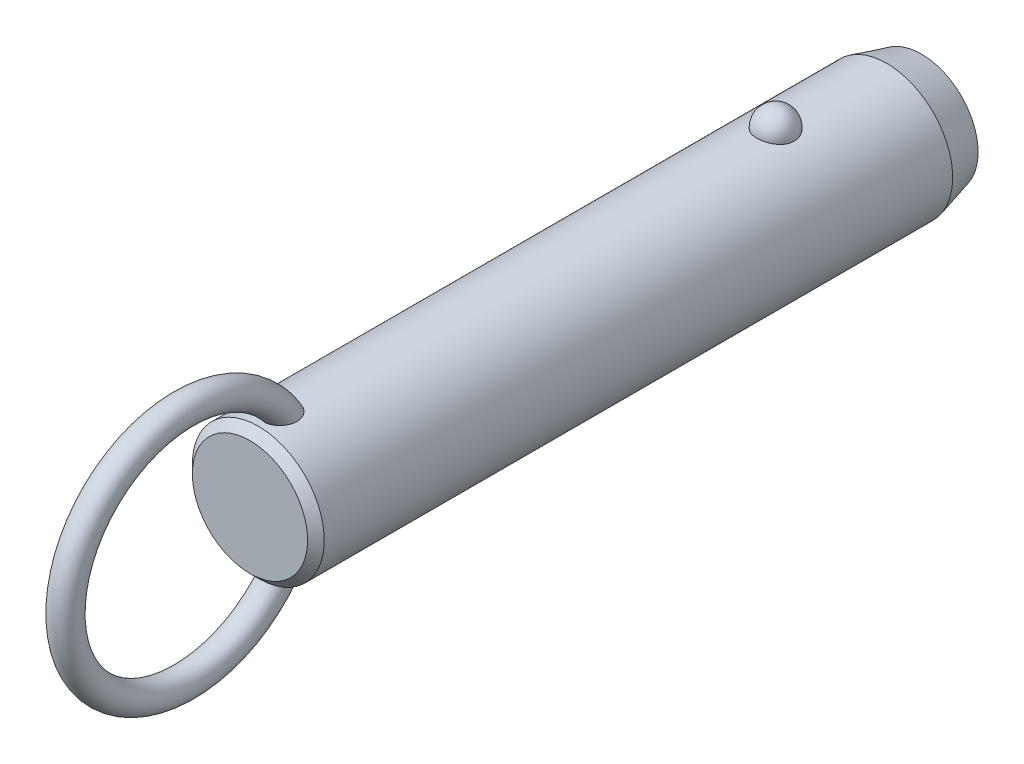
ISO-10303-21;
HEADER;
FILE_DESCRIPTION(('STEP AP214'),'2;1');
FILE_NAME('part.step','',(''),(''),'','','');
FILE_SCHEMA(('AUTOMOTIVE_DESIGN { 1 0 10303 214 1 1 1 1 }'));
ENDSEC;
DATA;
#1=APPLICATION_CONTEXT('core data for automotive mechanical design processes');
#2=APPLICATION_PROTOCOL_DEFINITION('international standard','automotive_design',2000,#1);
#3=PRODUCT_CONTEXT('',#1,'mechanical');
#4=PRODUCT('Part','Part','',(#3));
#5=PRODUCT_RELATED_PRODUCT_CATEGORY('part','',(#4));
#6=PRODUCT_DEFINITION_FORMATION('','',#4);
#7=PRODUCT_DEFINITION_CONTEXT('part definition',#1,'design');
#8=PRODUCT_DEFINITION('design','',#6,#7);
#9=PRODUCT_DEFINITION_SHAPE('','',#8);
#10=(LENGTH_UNIT() NAMED_UNIT(*) SI_UNIT(.MILLI.,.METRE.));
#11=(NAMED_UNIT(*) PLANE_ANGLE_UNIT() SI_UNIT($,.RADIAN.));
#12=(NAMED_UNIT(*) SI_UNIT($,.STERADIAN.) SOLID_ANGLE_UNIT());
#13=UNCERTAINTY_MEASURE_WITH_UNIT(LENGTH_MEASURE(1.E-05),#10,'distance_accuracy_value','');
#14=(GEOMETRIC_REPRESENTATION_CONTEXT(3) GLOBAL_UNCERTAINTY_ASSIGNED_CONTEXT((#13)) GLOBAL_UNIT_ASSIGNED_CONTEXT((#10,
#11,#12)) REPRESENTATION_CONTEXT('',''));
#15=CARTESIAN_POINT('',(0.,0.,0.));
#16=DIRECTION('',(0.,0.,1.));
#17=DIRECTION('',(1.,0.,0.));
#18=AXIS2_PLACEMENT_3D('',#15,#16,#17);
#19=CARTESIAN_POINT('',(0.,0.,63.5));
#20=DIRECTION('',(0.,0.,-1.));
#21=DIRECTION('',(-1.,0.,0.));
#22=AXIS2_PLACEMENT_3D('',#19,#20,#21);
#23=CYLINDRICAL_SURFACE('',#22,9.5);
#24=CARTESIAN_POINT('',(2.67259918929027,9.11631578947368,-2.70000000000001));
#25=CARTESIAN_POINT('',(2.6725968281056,9.11631786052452,-2.54909854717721));
#26=CARTESIAN_POINT('',(2.66030567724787,9.11994722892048,-2.39816735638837));
#27=CARTESIAN_POINT('',(2.6114347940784,9.13405924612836,-2.10058568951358));
#28=CARTESIAN_POINT('',(2.57484658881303,9.14454428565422,-1.95393672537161));
#29=CARTESIAN_POINT('',(2.47830875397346,9.17117631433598,-1.66916069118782));
#30=CARTESIAN_POINT('',(2.41836936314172,9.18732082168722,-1.53102991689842));
#31=CARTESIAN_POINT('',(2.27661331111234,9.22346780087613,-1.26705393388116));
#32=CARTESIAN_POINT('',(2.19479699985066,9.24347021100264,-1.14120852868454));
#33=CARTESIAN_POINT('',(2.01085282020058,9.28522401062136,-0.904632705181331));
#34=CARTESIAN_POINT('',(1.90862396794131,9.30698376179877,-0.793982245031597));
#35=CARTESIAN_POINT('',(1.6867437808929,9.34973971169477,-0.591607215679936));
#36=CARTESIAN_POINT('',(1.56709244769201,9.37073591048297,-0.499882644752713));
#37=CARTESIAN_POINT('',(1.31393976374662,9.40956370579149,-0.338167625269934));
#38=CARTESIAN_POINT('',(1.18048026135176,9.42740444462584,-0.268113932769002));
#39=CARTESIAN_POINT('',(0.903154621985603,9.45799906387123,-0.151390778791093));
#40=CARTESIAN_POINT('',(0.759289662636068,9.47075351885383,-0.104718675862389));
#41=CARTESIAN_POINT('',(0.468074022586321,9.48956256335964,-0.0367633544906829));
#42=CARTESIAN_POINT('',(0.320836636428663,9.49573643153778,-0.0150275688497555));
#43=CARTESIAN_POINT('',(0.0246714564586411,9.50112183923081,0.00396199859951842));
#44=CARTESIAN_POINT('',(-0.124256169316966,9.50033406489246,0.00121819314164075));
#45=CARTESIAN_POINT('',(-0.417264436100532,9.4919475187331,-0.0284441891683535));
#46=CARTESIAN_POINT('',(-0.56138413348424,9.48444885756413,-0.0550074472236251));
#47=CARTESIAN_POINT('',(-0.842986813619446,9.46357853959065,-0.131064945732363));
#48=CARTESIAN_POINT('',(-0.980469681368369,9.450206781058,-0.180559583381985));
#49=CARTESIAN_POINT('',(-1.24585005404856,9.41890822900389,-0.301476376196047));
#50=CARTESIAN_POINT('',(-1.37368611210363,9.40095498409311,-0.373026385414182));
#51=CARTESIAN_POINT('',(-1.61552738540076,9.36242964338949,-0.536025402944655));
#52=CARTESIAN_POINT('',(-1.72953116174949,9.34185727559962,-0.627476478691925));
#53=CARTESIAN_POINT('',(-1.9429225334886,9.29984568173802,-0.829844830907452));
#54=CARTESIAN_POINT('',(-2.04198021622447,9.27839736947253,-0.94110821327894));
#55=CARTESIAN_POINT('',(-2.22026460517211,9.23735994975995,-1.17883414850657));
#56=CARTESIAN_POINT('',(-2.29948985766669,9.21777097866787,-1.30529781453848));
#57=CARTESIAN_POINT('',(-2.43697287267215,9.18238994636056,-1.57158566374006));
#58=CARTESIAN_POINT('',(-2.49497068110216,9.16664569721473,-1.71155057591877));
#59=CARTESIAN_POINT('',(-2.5872073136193,9.14104303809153,-1.99961197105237));
#60=CARTESIAN_POINT('',(-2.62144683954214,9.13118445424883,-2.14770821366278));
#61=CARTESIAN_POINT('',(-2.66521466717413,9.11850622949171,-2.44715424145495));
#62=CARTESIAN_POINT('',(-2.67484831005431,9.11565658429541,-2.59848735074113));
#63=CARTESIAN_POINT('',(-2.66946735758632,9.11723375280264,-2.90067317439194));
#64=CARTESIAN_POINT('',(-2.65445345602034,9.12166036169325,-3.05152590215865));
#65=CARTESIAN_POINT('',(-2.60029711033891,9.13724422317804,-3.34766110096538));
#66=CARTESIAN_POINT('',(-2.56127978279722,9.14836656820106,-3.49296833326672));
#67=CARTESIAN_POINT('',(-2.46018844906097,9.17606676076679,-3.77477535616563));
#68=CARTESIAN_POINT('',(-2.39811349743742,9.1926448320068,-3.9112747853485));
#69=CARTESIAN_POINT('',(-2.25202303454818,9.22952198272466,-4.17244273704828));
#70=CARTESIAN_POINT('',(-2.16788714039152,9.24984129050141,-4.29704106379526));
#71=CARTESIAN_POINT('',(-1.9799408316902,9.29188255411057,-4.53013066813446));
#72=CARTESIAN_POINT('',(-1.87612963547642,9.31360456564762,-4.63862130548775));
#73=CARTESIAN_POINT('',(-1.65105429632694,9.35612959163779,-4.8369029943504));
#74=CARTESIAN_POINT('',(-1.52972405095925,9.37692871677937,-4.92661991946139));
#75=CARTESIAN_POINT('',(-1.27318250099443,9.41518970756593,-5.08429106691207));
#76=CARTESIAN_POINT('',(-1.13797219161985,9.432651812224,-5.15224684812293));
#77=CARTESIAN_POINT('',(-0.859280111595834,9.46208255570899,-5.26371827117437));
#78=CARTESIAN_POINT('',(-0.715925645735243,9.47411833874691,-5.30753421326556));
#79=CARTESIAN_POINT('',(-0.423550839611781,9.4916822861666,-5.37076321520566));
#80=CARTESIAN_POINT('',(-0.2745312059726,9.49721125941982,-5.39017930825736));
#81=CARTESIAN_POINT('',(0.0218446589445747,9.50110860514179,-5.40390587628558));
#82=CARTESIAN_POINT('',(0.16917707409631,9.49961381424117,-5.39869609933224));
#83=CARTESIAN_POINT('',(0.460808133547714,9.48993906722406,-5.36441955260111));
#84=CARTESIAN_POINT('',(0.605106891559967,9.48175936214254,-5.33535367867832));
#85=CARTESIAN_POINT('',(0.886027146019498,9.4596376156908,-5.25435587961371));
#86=CARTESIAN_POINT('',(1.02267710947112,9.44571881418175,-5.20251612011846));
#87=CARTESIAN_POINT('',(1.28523827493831,9.41358993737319,-5.07741549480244));
#88=CARTESIAN_POINT('',(1.41114877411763,9.39537958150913,-5.00415322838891));
#89=CARTESIAN_POINT('',(1.65085227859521,9.3562644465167,-4.83684599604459));
#90=CARTESIAN_POINT('',(1.76442346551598,9.33532178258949,-4.74249218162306));
#91=CARTESIAN_POINT('',(1.97425672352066,9.29321198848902,-4.53620389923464));
#92=CARTESIAN_POINT('',(2.07051582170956,9.27204482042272,-4.42426641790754));
#93=CARTESIAN_POINT('',(2.24490086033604,9.23139221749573,-4.18363183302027));
#94=CARTESIAN_POINT('',(2.32267019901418,9.21194380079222,-4.05466990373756));
#95=CARTESIAN_POINT('',(2.45584092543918,9.1773419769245,-3.78517836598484));
#96=CARTESIAN_POINT('',(2.5112497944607,9.16218713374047,-3.64465264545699));
#97=CARTESIAN_POINT('',(2.59380876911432,9.13913522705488,-3.37104301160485));
#98=CARTESIAN_POINT('',(2.62330266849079,9.13064624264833,-3.23871053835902));
#99=CARTESIAN_POINT('',(2.66269870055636,9.11923566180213,-2.97092664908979));
#100=CARTESIAN_POINT('',(2.67260130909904,9.11631393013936,-2.83547530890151));
#101=CARTESIAN_POINT('',(2.67259918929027,9.11631578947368,-2.70000000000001));
#102=B_SPLINE_CURVE_WITH_KNOTS('',3,(#24,#25,#26,#27,#28,#29,#30,#31,#32,#33,#34,#35,#36,#37,
#38,#39,#40,#41,#42,#43,#44,#45,#46,#47,#48,#49,#50,#51,#52,#53,#54,#55,#56,#57,#58,#59,#60,#61,
#62,#63,#64,#65,#66,#67,#68,#69,#70,#71,#72,#73,#74,#75,#76,#77,#78,#79,#80,#81,#82,#83,#84,#85,
#86,#87,#88,#89,#90,#91,#92,#93,#94,#95,#96,#97,#98,#99,#100,#101),.UNSPECIFIED.,.T.,.F.,(4,2,2,
2,2,2,2,2,2,2,2,2,2,2,2,2,2,2,2,2,2,2,2,2,2,2,2,2,2,2,2,2,2,2,2,2,2,2,4),(0.,0.452217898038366,
0.904593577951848,1.35677112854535,1.80894144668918,2.26340676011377,2.71787203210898,
3.17099820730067,3.62407318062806,4.0687883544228,4.51345969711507,4.95160616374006,
5.38976021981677,5.83050358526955,6.27129275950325,6.72071308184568,7.17016633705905,
7.62495278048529,8.07972578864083,8.53254856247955,8.98535859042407,9.43582813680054,
9.88631615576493,10.3393155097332,10.7923328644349,11.2471065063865,11.7018475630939,
12.150795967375,12.599688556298,13.0398725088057,13.4800399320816,13.9184421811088,
14.3568730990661,14.802202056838,15.2476074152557,15.7010097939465,16.1542603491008,
16.5602594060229,16.966248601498),.UNSPECIFIED.);
#103=CARTESIAN_POINT('',(2.67259918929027,9.11631578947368,-2.70000000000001));
#104=VERTEX_POINT('',#103);
#105=EDGE_CURVE('E41',#104,#104,#102,.T.);
#106=ORIENTED_EDGE('',*,*,#105,.T.);
#107=EDGE_LOOP('',(#106));
#108=FACE_BOUND('',#107,.T.);
#109=CARTESIAN_POINT('',(0.,0.,71.82));
#110=DIRECTION('',(0.,0.,1.));
#111=DIRECTION('',(1.,0.,0.));
#112=AXIS2_PLACEMENT_3D('',#109,#110,#111);
#113=CIRCLE('',#112,9.5);
#114=CARTESIAN_POINT('',(-9.50000000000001,0.,71.82));
#115=VERTEX_POINT('',#114);
#116=EDGE_CURVE('E10',#115,#115,#113,.F.);
#117=ORIENTED_EDGE('',*,*,#116,.T.);
#118=EDGE_LOOP('',(#117));
#119=FACE_BOUND('',#118,.T.);
#120=CARTESIAN_POINT('',(-0.697062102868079,-9.47439269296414,66.1678088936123));
#121=CARTESIAN_POINT('',(-0.799579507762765,-9.46685146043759,66.2074823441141));
#122=CARTESIAN_POINT('',(-0.898575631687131,-9.45788043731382,66.2559309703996));
#123=CARTESIAN_POINT('',(-1.08670047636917,-9.43811593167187,66.3688685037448));
#124=CARTESIAN_POINT('',(-1.17583204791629,-9.42732297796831,66.4333527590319));
#125=CARTESIAN_POINT('',(-1.34179806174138,-9.40513672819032,66.5762099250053));
#126=CARTESIAN_POINT('',(-1.41865133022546,-9.39374438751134,66.654561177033));
#127=CARTESIAN_POINT('',(-1.5586004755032,-9.37154196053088,66.8227524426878));
#128=CARTESIAN_POINT('',(-1.62169476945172,-9.3607319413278,66.9125937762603));
#129=CARTESIAN_POINT('',(-1.73527695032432,-9.34035749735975,67.1045001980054));
#130=CARTESIAN_POINT('',(-1.7852226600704,-9.33085270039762,67.2068910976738));
#131=CARTESIAN_POINT('',(-1.86924997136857,-9.3143834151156,67.418148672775));
#132=CARTESIAN_POINT('',(-1.90332570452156,-9.30741986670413,67.5270177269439));
#133=CARTESIAN_POINT('',(-1.95893603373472,-9.29588482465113,67.7604730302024));
#134=CARTESIAN_POINT('',(-1.97872420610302,-9.29165182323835,67.8854890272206));
#135=CARTESIAN_POINT('',(-2.00062129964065,-9.28695978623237,68.1370805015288));
#136=CARTESIAN_POINT('',(-2.00272284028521,-9.28650232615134,68.263656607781));
#137=CARTESIAN_POINT('',(-1.98958876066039,-9.28932750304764,68.5368157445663));
#138=CARTESIAN_POINT('',(-1.97143366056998,-9.2932400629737,68.6832519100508));
#139=CARTESIAN_POINT('',(-1.91479925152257,-9.30507151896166,68.9720629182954));
#140=CARTESIAN_POINT('',(-1.87629122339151,-9.31299607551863,69.114431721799));
#141=CARTESIAN_POINT('',(-1.77225683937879,-9.33340232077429,69.4151725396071));
#142=CARTESIAN_POINT('',(-1.70334898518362,-9.34641636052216,69.5723691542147));
#143=CARTESIAN_POINT('',(-1.58111062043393,-9.36759153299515,69.7975171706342));
#144=CARTESIAN_POINT('',(-1.53721459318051,-9.37492619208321,69.8707968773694));
#145=CARTESIAN_POINT('',(-1.44302631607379,-9.38988566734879,70.0130740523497));
#146=CARTESIAN_POINT('',(-1.39273721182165,-9.39751033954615,70.0820736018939));
#147=CARTESIAN_POINT('',(-1.26775962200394,-9.41530678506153,70.2369832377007));
#148=CARTESIAN_POINT('',(-1.19052326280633,-9.42548108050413,70.3208712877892));
#149=CARTESIAN_POINT('',(-1.02420241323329,-9.44499825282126,70.4760086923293));
#150=CARTESIAN_POINT('',(-0.935139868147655,-9.45434261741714,70.5472808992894));
#151=CARTESIAN_POINT('',(-0.766610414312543,-9.46930670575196,70.6586955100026));
#152=CARTESIAN_POINT('',(-0.689439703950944,-9.47529223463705,70.7022354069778));
#153=CARTESIAN_POINT('',(-0.528942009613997,-9.48560294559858,70.7763133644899));
#154=CARTESIAN_POINT('',(-0.445620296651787,-9.48992953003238,70.8068624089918));
#155=CARTESIAN_POINT('',(-0.273901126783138,-9.49644161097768,70.8525792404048));
#156=CARTESIAN_POINT('',(-0.185465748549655,-9.49860811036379,70.86761059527));
#157=CARTESIAN_POINT('',(-0.00734541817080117,-9.5004135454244,70.8801494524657));
#158=CARTESIAN_POINT('',(0.0823387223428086,-9.50005405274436,70.8776678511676));
#159=CARTESIAN_POINT('',(0.247679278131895,-9.49708301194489,70.8569959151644));
#160=CARTESIAN_POINT('',(0.323620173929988,-9.49477609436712,70.8409300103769));
#161=CARTESIAN_POINT('',(0.471981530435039,-9.48855917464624,70.7971726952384));
#162=CARTESIAN_POINT('',(0.544400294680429,-9.48464840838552,70.769475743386));
#163=CARTESIAN_POINT('',(0.70894789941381,-9.47398336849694,70.6928026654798));
#164=CARTESIAN_POINT('',(0.799149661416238,-9.46671310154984,70.6397745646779));
#165=CARTESIAN_POINT('',(0.969783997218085,-9.45076225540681,70.5199731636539));
#166=CARTESIAN_POINT('',(1.05019415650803,-9.44207854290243,70.4531692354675));
#167=CARTESIAN_POINT('',(1.23092343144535,-9.42051459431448,70.2807596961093));
#168=CARTESIAN_POINT('',(1.3265249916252,-9.40733378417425,70.1702619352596));
#169=CARTESIAN_POINT('',(1.49893121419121,-9.38140745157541,69.9355614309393));
#170=CARTESIAN_POINT('',(1.57571616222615,-9.36866239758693,69.8113445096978));
#171=CARTESIAN_POINT('',(1.71285426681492,-9.34457644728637,69.5493891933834));
#172=CARTESIAN_POINT('',(1.77266365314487,-9.33328726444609,69.4113623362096));
#173=CARTESIAN_POINT('',(1.87239208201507,-9.31379209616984,69.1280515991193));
#174=CARTESIAN_POINT('',(1.9123015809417,-9.3055875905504,68.982764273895));
#175=CARTESIAN_POINT('',(1.97604189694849,-9.29228394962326,68.6620281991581));
#176=CARTESIAN_POINT('',(1.99587438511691,-9.28797202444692,68.4857248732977));
#177=CARTESIAN_POINT('',(2.0029570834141,-9.28645519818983,68.1324146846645));
#178=CARTESIAN_POINT('',(1.99025930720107,-9.28923895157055,67.9554093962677));
#179=CARTESIAN_POINT('',(1.93735479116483,-9.30038134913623,67.6563381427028));
#180=CARTESIAN_POINT('',(1.90576827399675,-9.30697680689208,67.5326679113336));
#181=CARTESIAN_POINT('',(1.82287484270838,-9.32356855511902,67.292329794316));
#182=CARTESIAN_POINT('',(1.77158213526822,-9.33356239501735,67.1756569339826));
#183=CARTESIAN_POINT('',(1.64885744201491,-9.35602275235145,66.9527061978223));
#184=CARTESIAN_POINT('',(1.57730995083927,-9.36850332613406,66.8464927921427));
#185=CARTESIAN_POINT('',(1.4154326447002,-9.39431873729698,66.6495530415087));
#186=CARTESIAN_POINT('',(1.32510883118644,-9.40765330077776,66.5588217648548));
#187=CARTESIAN_POINT('',(1.13846223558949,-9.43195720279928,66.4050334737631));
#188=CARTESIAN_POINT('',(1.04369890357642,-9.44302894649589,66.3400947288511));
#189=CARTESIAN_POINT('',(0.843965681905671,-9.46296805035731,66.2280388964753));
#190=CARTESIAN_POINT('',(0.739000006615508,-9.47183631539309,66.1809144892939));
#191=CARTESIAN_POINT('',(0.528175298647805,-9.48586140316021,66.1081173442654));
#192=CARTESIAN_POINT('',(0.422686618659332,-9.49119633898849,66.0814024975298));
#193=CARTESIAN_POINT('',(0.208590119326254,-9.49831365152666,66.0460137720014));
#194=CARTESIAN_POINT('',(0.0999817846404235,-9.500095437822,66.0373428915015));
#195=CARTESIAN_POINT('',(-0.126104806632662,-9.49988861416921,66.0383501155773));
#196=CARTESIAN_POINT('',(-0.24357872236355,-9.49757821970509,66.0495942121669));
#197=CARTESIAN_POINT('',(-0.474390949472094,-9.48885165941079,66.093167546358));
#198=CARTESIAN_POINT('',(-0.587729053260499,-9.48243528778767,66.1254978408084));
#199=CARTESIAN_POINT('',(-0.697062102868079,-9.47439269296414,66.1678088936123));
#200=B_SPLINE_CURVE_WITH_KNOTS('',3,(#120,#121,#122,#123,#124,#125,#126,#127,#128,#129,#130,
#131,#132,#133,#134,#135,#136,#137,#138,#139,#140,#141,#142,#143,#144,#145,#146,#147,#148,#149,
#150,#151,#152,#153,#154,#155,#156,#157,#158,#159,#160,#161,#162,#163,#164,#165,#166,#167,#168,
#169,#170,#171,#172,#173,#174,#175,#176,#177,#178,#179,#180,#181,#182,#183,#184,#185,#186,#187,
#188,#189,#190,#191,#192,#193,#194,#195,#196,#197,#198,#199),.UNSPECIFIED.,.T.,.F.,(4,2,2,2,2,2,
2,2,2,2,2,2,2,2,2,2,2,2,2,2,2,2,2,2,2,2,2,2,2,2,2,2,2,2,2,2,2,2,2,4),(0.,0.330119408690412,
0.660143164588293,0.989655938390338,1.31920659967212,1.66074728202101,2.00241415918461,
2.38088696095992,2.7595176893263,3.20065679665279,3.6424200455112,4.15620996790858,
4.4131416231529,4.66994734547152,5.01228664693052,5.35399933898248,5.61943037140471,
5.88463652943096,6.15215502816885,6.41950709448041,6.65144391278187,6.88349136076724,
7.19641200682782,7.51003602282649,7.94779711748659,8.38601491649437,8.83699707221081,
9.28819530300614,9.81778662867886,10.3465317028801,10.7284172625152,11.110028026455,
11.4938603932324,11.8775702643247,12.2220189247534,12.5663259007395,12.8915939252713,
13.2169159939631,13.5689650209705,13.9210316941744),.UNSPECIFIED.);
#201=CARTESIAN_POINT('',(-0.697062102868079,-9.47439269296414,66.1678088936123));
#202=VERTEX_POINT('',#201);
#203=EDGE_CURVE('E59',#202,#202,#200,.T.);
#204=ORIENTED_EDGE('',*,*,#203,.T.);
#205=EDGE_LOOP('',(#204));
#206=FACE_BOUND('',#205,.T.);
#207=CARTESIAN_POINT('',(-0.697062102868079,9.47439269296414,66.1678088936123));
#208=CARTESIAN_POINT('',(-0.59779262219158,9.48169483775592,66.1293956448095));
#209=CARTESIAN_POINT('',(-0.495106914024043,9.48766580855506,66.0991682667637));
#210=CARTESIAN_POINT('',(-0.285876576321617,9.49627648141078,66.0560327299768));
#211=CARTESIAN_POINT('',(-0.179324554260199,9.49890941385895,66.0431597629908));
#212=CARTESIAN_POINT('',(0.0344157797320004,9.50053798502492,66.0351666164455));
#213=CARTESIAN_POINT('',(0.141603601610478,9.49953613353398,66.0400341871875));
#214=CARTESIAN_POINT('',(0.353563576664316,9.49401038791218,66.0673654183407));
#215=CARTESIAN_POINT('',(0.458336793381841,9.48948807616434,66.08982117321));
#216=CARTESIAN_POINT('',(0.66249373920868,9.4774236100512,66.1516719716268));
#217=CARTESIAN_POINT('',(0.761881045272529,9.46988348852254,66.1910556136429));
#218=CARTESIAN_POINT('',(0.952608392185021,9.45260382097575,66.2856342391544));
#219=CARTESIAN_POINT('',(1.04394806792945,9.44286417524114,66.3408299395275));
#220=CARTESIAN_POINT('',(1.21712767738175,9.42211760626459,66.4660662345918));
#221=CARTESIAN_POINT('',(1.29885671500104,9.41109835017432,66.5362579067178));
#222=CARTESIAN_POINT('',(1.44978975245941,9.38903310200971,66.688980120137));
#223=CARTESIAN_POINT('',(1.51899278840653,9.37798710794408,66.7715116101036));
#224=CARTESIAN_POINT('',(1.64602857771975,9.35654375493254,66.9497763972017));
#225=CARTESIAN_POINT('',(1.70333052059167,9.34618688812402,67.0458916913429));
#226=CARTESIAN_POINT('',(1.80259341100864,9.32755128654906,67.245897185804));
#227=CARTESIAN_POINT('',(1.84454942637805,9.31927322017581,67.3497898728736));
#228=CARTESIAN_POINT('',(1.91637039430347,9.30478365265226,67.572213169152));
#229=CARTESIAN_POINT('',(1.944805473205,9.29882552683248,67.6912192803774));
#230=CARTESIAN_POINT('',(1.98449865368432,9.29043398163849,67.9321436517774));
#231=CARTESIAN_POINT('',(1.99574908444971,9.28800213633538,68.0540631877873));
#232=CARTESIAN_POINT('',(2.00275141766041,9.28649645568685,68.3169324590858));
#233=CARTESIAN_POINT('',(1.99588238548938,9.28799035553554,68.4579529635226));
#234=CARTESIAN_POINT('',(1.96270559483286,9.29505517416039,68.7376217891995));
#235=CARTESIAN_POINT('',(1.93637872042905,9.30063010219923,68.876267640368));
#236=CARTESIAN_POINT('',(1.85949176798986,9.31633564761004,69.1725616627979));
#237=CARTESIAN_POINT('',(1.80549792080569,9.3270926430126,69.3292907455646));
#238=CARTESIAN_POINT('',(1.67376869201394,9.3516306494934,69.6322840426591));
#239=CARTESIAN_POINT('',(1.59603181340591,9.36541185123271,69.7785475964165));
#240=CARTESIAN_POINT('',(1.4360277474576,9.39110706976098,70.0258138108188));
#241=CARTESIAN_POINT('',(1.35831795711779,9.40278656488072,70.129791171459));
#242=CARTESIAN_POINT('',(1.18774483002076,9.42585025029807,70.3245347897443));
#243=CARTESIAN_POINT('',(1.09490932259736,9.43723493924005,70.4153247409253));
#244=CARTESIAN_POINT('',(0.921110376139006,9.45552616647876,70.5562033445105));
#245=CARTESIAN_POINT('',(0.843738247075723,9.46281058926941,70.6106563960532));
#246=CARTESIAN_POINT('',(0.681245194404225,9.47589120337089,70.7067117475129));
#247=CARTESIAN_POINT('',(0.596135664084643,9.48168953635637,70.7483325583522));
#248=CARTESIAN_POINT('',(0.433779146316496,9.49038144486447,70.8100899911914));
#249=CARTESIAN_POINT('',(0.357459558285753,9.49359170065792,70.8326013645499));
#250=CARTESIAN_POINT('',(0.202074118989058,9.49816761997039,70.8645745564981));
#251=CARTESIAN_POINT('',(0.123010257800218,9.49953459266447,70.8740456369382));
#252=CARTESIAN_POINT('',(-0.0357372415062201,9.50026497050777,70.8791143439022));
#253=CARTESIAN_POINT('',(-0.115421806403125,9.49962433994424,70.8746840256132));
#254=CARTESIAN_POINT('',(-0.272823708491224,9.49640854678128,70.8522962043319));
#255=CARTESIAN_POINT('',(-0.350540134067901,9.4938325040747,70.8343325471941));
#256=CARTESIAN_POINT('',(-0.500580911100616,9.4870946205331,70.7868028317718));
#257=CARTESIAN_POINT('',(-0.57297929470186,9.48296359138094,70.7574618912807));
#258=CARTESIAN_POINT('',(-0.712864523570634,9.47347609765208,70.6890087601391));
#259=CARTESIAN_POINT('',(-0.780349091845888,9.46811906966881,70.6498920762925));
#260=CARTESIAN_POINT('',(-0.946309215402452,9.45329720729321,70.5394327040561));
#261=CARTESIAN_POINT('',(-1.04090230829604,9.44321512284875,70.4623297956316));
#262=CARTESIAN_POINT('',(-1.21661929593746,9.42219227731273,70.2940971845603));
#263=CARTESIAN_POINT('',(-1.29770519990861,9.41124921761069,70.2029292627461));
#264=CARTESIAN_POINT('',(-1.47319646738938,9.38563439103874,69.9761621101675));
#265=CARTESIAN_POINT('',(-1.56208878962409,9.37102009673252,69.8362895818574));
#266=CARTESIAN_POINT('',(-1.71623987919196,9.34401559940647,69.5439503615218));
#267=CARTESIAN_POINT('',(-1.78147866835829,9.33162728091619,69.391473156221));
#268=CARTESIAN_POINT('',(-1.88853837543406,9.31055541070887,69.0756470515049));
#269=CARTESIAN_POINT('',(-1.92998995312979,9.30193076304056,68.9121685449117));
#270=CARTESIAN_POINT('',(-1.98590726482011,9.29015757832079,68.5805268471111));
#271=CARTESIAN_POINT('',(-2.0004070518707,9.2870021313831,68.4123698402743));
#272=CARTESIAN_POINT('',(-1.99964701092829,9.28716218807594,68.1050806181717));
#273=CARTESIAN_POINT('',(-1.98908145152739,9.28945704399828,67.9659362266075));
#274=CARTESIAN_POINT('',(-1.94566294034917,9.29865169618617,67.6911539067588));
#275=CARTESIAN_POINT('',(-1.91282062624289,9.30554929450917,67.555514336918));
#276=CARTESIAN_POINT('',(-1.84582133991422,9.31898248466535,67.3578026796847));
#277=CARTESIAN_POINT('',(-1.82038084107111,9.32400364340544,67.292583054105));
#278=CARTESIAN_POINT('',(-1.7635051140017,9.33492884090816,67.1649033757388));
#279=CARTESIAN_POINT('',(-1.73207305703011,9.34083241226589,67.1024418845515));
#280=CARTESIAN_POINT('',(-1.6632424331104,9.353333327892,66.9809407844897));
#281=CARTESIAN_POINT('',(-1.62584239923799,9.35993084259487,66.9219020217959));
#282=CARTESIAN_POINT('',(-1.54527678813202,9.37356864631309,66.8079875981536));
#283=CARTESIAN_POINT('',(-1.50211241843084,9.38060884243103,66.7531110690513));
#284=CARTESIAN_POINT('',(-1.37681147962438,9.40004442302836,66.6099619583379));
#285=CARTESIAN_POINT('',(-1.28916358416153,9.41261047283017,66.5264295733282));
#286=CARTESIAN_POINT('',(-1.09996826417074,9.43658180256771,66.3772360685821));
#287=CARTESIAN_POINT('',(-0.998461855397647,9.44799034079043,66.3115238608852));
#288=CARTESIAN_POINT('',(-0.860188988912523,9.46103017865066,66.2394367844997));
#289=CARTESIAN_POINT('',(-0.828141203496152,9.46389141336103,66.2238511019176));
#290=CARTESIAN_POINT('',(-0.763210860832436,9.46934915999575,66.1944734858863));
#291=CARTESIAN_POINT('',(-0.730328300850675,9.47194567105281,66.1806815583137));
#292=CARTESIAN_POINT('',(-0.697062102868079,9.47439269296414,66.1678088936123));
#293=B_SPLINE_CURVE_WITH_KNOTS('',3,(#207,#208,#209,#210,#211,#212,#213,#214,#215,#216,#217,
#218,#219,#220,#221,#222,#223,#224,#225,#226,#227,#228,#229,#230,#231,#232,#233,#234,#235,#236,
#237,#238,#239,#240,#241,#242,#243,#244,#245,#246,#247,#248,#249,#250,#251,#252,#253,#254,#255,
#256,#257,#258,#259,#260,#261,#262,#263,#264,#265,#266,#267,#268,#269,#270,#271,#272,#273,#274,
#275,#276,#277,#278,#279,#280,#281,#282,#283,#284,#285,#286,#287,#288,#289,#290,#291,#292),
.UNSPECIFIED.,.T.,.F.,(4,2,2,2,2,2,2,2,2,2,2,2,2,2,2,2,2,2,2,2,2,2,2,2,2,2,2,2,2,2,2,2,2,2,2,2,
2,2,2,2,2,2,4),(0.,0.319942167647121,0.640532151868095,0.960900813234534,1.28112555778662,
1.60113495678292,1.92115886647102,2.24457323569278,2.56801248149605,2.90371927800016,
3.23953387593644,3.60560313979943,3.97183576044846,4.39383693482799,4.81625324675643,
5.31257045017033,5.80891895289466,6.19868344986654,6.58773876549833,6.87145417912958,
7.15475838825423,7.3926375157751,7.63034760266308,7.86853584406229,8.10683246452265,
8.3406366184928,8.57454843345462,8.93983939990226,9.30614105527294,9.8026666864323,
10.2996107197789,10.8040753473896,11.3079021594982,11.7249776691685,12.1418541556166,
12.3521485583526,12.562331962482,12.7725671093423,12.9827582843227,13.3458276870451,
13.7078449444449,13.8150604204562,13.9222762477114),.UNSPECIFIED.);
#294=CARTESIAN_POINT('',(-0.697062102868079,9.47439269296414,66.1678088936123));
#295=VERTEX_POINT('',#294);
#296=EDGE_CURVE('E67',#295,#295,#293,.T.);
#297=ORIENTED_EDGE('',*,*,#296,.T.);
#298=EDGE_LOOP('',(#297));
#299=FACE_BOUND('',#298,.T.);
#300=CARTESIAN_POINT('',(0.,0.,-18.6999999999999));
#301=DIRECTION('',(0.,0.,-1.));
#302=DIRECTION('',(-1.,0.,0.));
#303=AXIS2_PLACEMENT_3D('',#300,#301,#302);
#304=CIRCLE('',#303,9.5);
#305=CARTESIAN_POINT('',(-9.5,0.,-18.6999999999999));
#306=VERTEX_POINT('',#305);
#307=EDGE_CURVE('E56',#306,#306,#304,.F.);
#308=ORIENTED_EDGE('',*,*,#307,.T.);
#309=EDGE_LOOP('',(#308));
#310=FACE_BOUND('',#309,.T.);
#311=ADVANCED_FACE('F37',(#108,#119,#206,#299,#310),#23,.T.);
#312=CARTESIAN_POINT('',(0.,0.,-23.7));
#313=DIRECTION('',(0.,0.,-1.));
#314=DIRECTION('',(-1.,0.,0.));
#315=AXIS2_PLACEMENT_3D('',#312,#313,#314);
#316=PLANE('',#315);
#317=CARTESIAN_POINT('',(0.,0.,-23.7));
#318=DIRECTION('',(0.,0.,-1.));
#319=DIRECTION('',(-1.,0.,0.));
#320=AXIS2_PLACEMENT_3D('',#317,#318,#319);
#321=CIRCLE('',#320,8.16025403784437);
#322=CARTESIAN_POINT('',(-8.16025403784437,0.,-23.7));
#323=VERTEX_POINT('',#322);
#324=EDGE_CURVE('E66',#323,#323,#321,.T.);
#325=ORIENTED_EDGE('',*,*,#324,.T.);
#326=EDGE_LOOP('',(#325));
#327=FACE_BOUND('',#326,.T.);
#328=ADVANCED_FACE('F85',(#327),#316,.T.);
#329=CARTESIAN_POINT('',(0.,0.,-23.7));
#330=DIRECTION('',(0.,0.,1.));
#331=DIRECTION('',(1.,0.,0.));
#332=AXIS2_PLACEMENT_3D('',#329,#330,#331);
#333=CONICAL_SURFACE('',#332,8.16025403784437,0.261799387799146);
#334=ORIENTED_EDGE('',*,*,#307,.F.);
#335=EDGE_LOOP('',(#334));
#336=FACE_BOUND('',#335,.T.);
#337=ORIENTED_EDGE('',*,*,#324,.F.);
#338=EDGE_LOOP('',(#337));
#339=FACE_BOUND('',#338,.T.);
#340=ADVANCED_FACE('F83',(#336,#339),#333,.T.);
#341=CARTESIAN_POINT('',(0.,0.,73.02));
#342=DIRECTION('',(0.,0.,1.));
#343=DIRECTION('',(1.,0.,0.));
#344=AXIS2_PLACEMENT_3D('',#341,#342,#343);
#345=PLANE('',#344);
#346=CARTESIAN_POINT('',(0.,0.,73.02));
#347=DIRECTION('',(0.,0.,1.));
#348=DIRECTION('',(1.,0.,0.));
#349=AXIS2_PLACEMENT_3D('',#346,#347,#348);
#350=CIRCLE('',#349,8.29999999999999);
#351=CARTESIAN_POINT('',(-8.3,0.,73.02));
#352=VERTEX_POINT('',#351);
#353=EDGE_CURVE('E50',#352,#352,#350,.T.);
#354=ORIENTED_EDGE('',*,*,#353,.T.);
#355=EDGE_LOOP('',(#354));
#356=FACE_BOUND('',#355,.T.);
#357=ADVANCED_FACE('F77',(#356),#345,.T.);
#358=CARTESIAN_POINT('',(0.,0.,82.55));
#359=DIRECTION('',(1.,0.,0.));
#360=DIRECTION('',(0.,0.,-1.));
#361=AXIS2_PLACEMENT_3D('',#358,#359,#360);
#362=TOROIDAL_SURFACE('',#361,17.05,2.);
#363=ORIENTED_EDGE('',*,*,#296,.F.);
#364=EDGE_LOOP('',(#363));
#365=FACE_BOUND('',#364,.T.);
#366=ORIENTED_EDGE('',*,*,#203,.F.);
#367=EDGE_LOOP('',(#366));
#368=FACE_BOUND('',#367,.T.);
#369=ADVANCED_FACE('F73',(#365,#368),#362,.T.);
#370=CARTESIAN_POINT('',(0.,0.,73.02));
#371=DIRECTION('',(0.,0.,-1.));
#372=DIRECTION('',(-1.,0.,0.));
#373=AXIS2_PLACEMENT_3D('',#370,#371,#372);
#374=CONICAL_SURFACE('',#373,8.29999999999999,0.785398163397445);
#375=CARTESIAN_POINT('',(-9.50000000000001,0.,71.82));
#376=CARTESIAN_POINT('',(-9.48750000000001,0.,71.8325));
#377=CARTESIAN_POINT('',(-9.47500000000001,0.,71.845));
#378=CARTESIAN_POINT('',(-9.45,0.,71.87));
#379=CARTESIAN_POINT('',(-9.43750000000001,0.,71.8825));
#380=CARTESIAN_POINT('',(-9.41250000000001,0.,71.9075));
#381=CARTESIAN_POINT('',(-9.40000000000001,0.,71.92));
#382=CARTESIAN_POINT('',(-9.37500000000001,0.,71.945));
#383=CARTESIAN_POINT('',(-9.36250000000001,0.,71.9575));
#384=CARTESIAN_POINT('',(-9.33750000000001,0.,71.9825));
#385=CARTESIAN_POINT('',(-9.325,0.,71.995));
#386=CARTESIAN_POINT('',(-9.3,0.,72.02));
#387=CARTESIAN_POINT('',(-9.2875,0.,72.0325));
#388=CARTESIAN_POINT('',(-9.2625,0.,72.0575));
#389=CARTESIAN_POINT('',(-9.25000000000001,0.,72.07));
#390=CARTESIAN_POINT('',(-9.225,0.,72.095));
#391=CARTESIAN_POINT('',(-9.2125,0.,72.1075));
#392=CARTESIAN_POINT('',(-9.1875,0.,72.1325));
#393=CARTESIAN_POINT('',(-9.175,0.,72.145));
#394=CARTESIAN_POINT('',(-9.15000000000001,0.,72.17));
#395=CARTESIAN_POINT('',(-9.1375,0.,72.1825));
#396=CARTESIAN_POINT('',(-9.1125,0.,72.2075));
#397=CARTESIAN_POINT('',(-9.1,0.,72.22));
#398=CARTESIAN_POINT('',(-9.075,0.,72.245));
#399=CARTESIAN_POINT('',(-9.0625,0.,72.2575));
#400=CARTESIAN_POINT('',(-9.0375,0.,72.2825));
#401=CARTESIAN_POINT('',(-9.025,0.,72.295));
#402=CARTESIAN_POINT('',(-9.,0.,72.32));
#403=CARTESIAN_POINT('',(-8.9875,0.,72.3325));
#404=CARTESIAN_POINT('',(-8.9625,0.,72.3575));
#405=CARTESIAN_POINT('',(-8.95,0.,72.37));
#406=CARTESIAN_POINT('',(-8.925,0.,72.395));
#407=CARTESIAN_POINT('',(-8.9125,0.,72.4075));
#408=CARTESIAN_POINT('',(-8.8875,0.,72.4325));
#409=CARTESIAN_POINT('',(-8.875,0.,72.445));
#410=CARTESIAN_POINT('',(-8.85,0.,72.47));
#411=CARTESIAN_POINT('',(-8.8375,0.,72.4825));
#412=CARTESIAN_POINT('',(-8.8125,0.,72.5075));
#413=CARTESIAN_POINT('',(-8.8,0.,72.52));
#414=CARTESIAN_POINT('',(-8.775,0.,72.545));
#415=CARTESIAN_POINT('',(-8.7625,0.,72.5575));
#416=CARTESIAN_POINT('',(-8.7375,0.,72.5825));
#417=CARTESIAN_POINT('',(-8.725,0.,72.595));
#418=CARTESIAN_POINT('',(-8.7,0.,72.62));
#419=CARTESIAN_POINT('',(-8.6875,0.,72.6325));
#420=CARTESIAN_POINT('',(-8.6625,0.,72.6575));
#421=CARTESIAN_POINT('',(-8.65,0.,72.67));
#422=CARTESIAN_POINT('',(-8.625,0.,72.695));
#423=CARTESIAN_POINT('',(-8.6125,0.,72.7075));
#424=CARTESIAN_POINT('',(-8.5875,0.,72.7325));
#425=CARTESIAN_POINT('',(-8.575,0.,72.745));
#426=CARTESIAN_POINT('',(-8.55,0.,72.77));
#427=CARTESIAN_POINT('',(-8.5375,0.,72.7825));
#428=CARTESIAN_POINT('',(-8.5125,0.,72.8075));
#429=CARTESIAN_POINT('',(-8.5,0.,72.82));
#430=CARTESIAN_POINT('',(-8.475,0.,72.845));
#431=CARTESIAN_POINT('',(-8.4625,0.,72.8575));
#432=CARTESIAN_POINT('',(-8.43749999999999,0.,72.8825));
#433=CARTESIAN_POINT('',(-8.425,0.,72.895));
#434=CARTESIAN_POINT('',(-8.4,0.,72.92));
#435=CARTESIAN_POINT('',(-8.3875,0.,72.9325));
#436=CARTESIAN_POINT('',(-8.3625,0.,72.9575));
#437=CARTESIAN_POINT('',(-8.35,0.,72.97));
#438=CARTESIAN_POINT('',(-8.32499999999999,0.,72.995));
#439=CARTESIAN_POINT('',(-8.31249999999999,0.,73.0075));
#440=CARTESIAN_POINT('',(-8.3,0.,73.02));
#441=B_SPLINE_CURVE_WITH_KNOTS('',3,(#375,#376,#377,#378,#379,#380,#381,#382,#383,#384,#385,
#386,#387,#388,#389,#390,#391,#392,#393,#394,#395,#396,#397,#398,#399,#400,#401,#402,#403,#404,
#405,#406,#407,#408,#409,#410,#411,#412,#413,#414,#415,#416,#417,#418,#419,#420,#421,#422,#423,
#424,#425,#426,#427,#428,#429,#430,#431,#432,#433,#434,#435,#436,#437,#438,#439,#440),
.UNSPECIFIED.,.F.,.F.,(4,2,2,2,2,2,2,2,2,2,2,2,2,2,2,2,2,2,2,2,2,2,2,2,2,2,2,2,2,2,2,2,4),(0.,
0.0530330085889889,0.106066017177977,0.159099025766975,0.212132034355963,0.265165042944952,
0.318198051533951,0.371231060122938,0.424264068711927,0.477297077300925,0.530330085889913,
0.583363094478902,0.6363961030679,0.689429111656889,0.742462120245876,0.795495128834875,
0.848528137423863,0.901561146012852,0.95459415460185,1.00762716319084,1.06066017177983,
1.11369318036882,1.16672618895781,1.2197591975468,1.2727922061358,1.32582521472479,
1.37885822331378,1.43189123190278,1.48492424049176,1.53795724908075,1.59099025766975,
1.64402326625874,1.69705627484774),.UNSPECIFIED.);
#442=EDGE_CURVE('BSEAM39',#115,#352,#441,.T.);
#443=ORIENTED_EDGE('',*,*,#116,.F.);
#444=ORIENTED_EDGE('',*,*,#353,.F.);
#445=ORIENTED_EDGE('',*,*,#442,.T.);
#446=ORIENTED_EDGE('',*,*,#442,.F.);
#447=EDGE_LOOP('',(#443,#445,#444,#446));
#448=FACE_BOUND('',#447,.T.);
#449=ADVANCED_FACE('F39',(#448),#374,.T.);
#450=CARTESIAN_POINT('',(0.,9.5,-2.70000000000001));
#451=DIRECTION('',(0.,1.,0.));
#452=DIRECTION('',(0.,0.,-1.));
#453=AXIS2_PLACEMENT_3D('',#450,#451,#452);
#454=SPHERICAL_SURFACE('',#453,2.7);
#455=ORIENTED_EDGE('',*,*,#105,.F.);
#456=EDGE_LOOP('',(#455));
#457=FACE_BOUND('',#456,.T.);
#458=ADVANCED_FACE('F79',(#457),#454,.T.);
#459=CLOSED_SHELL('',(#311,#328,#340,#357,#369,#449,#458));
#460=MANIFOLD_SOLID_BREP('B2',#459);
#461=ADVANCED_BREP_SHAPE_REPRESENTATION('',(#18,#460),#14);
#462=SHAPE_DEFINITION_REPRESENTATION(#9,#461);
ENDSEC;
END-ISO-10303-21;
